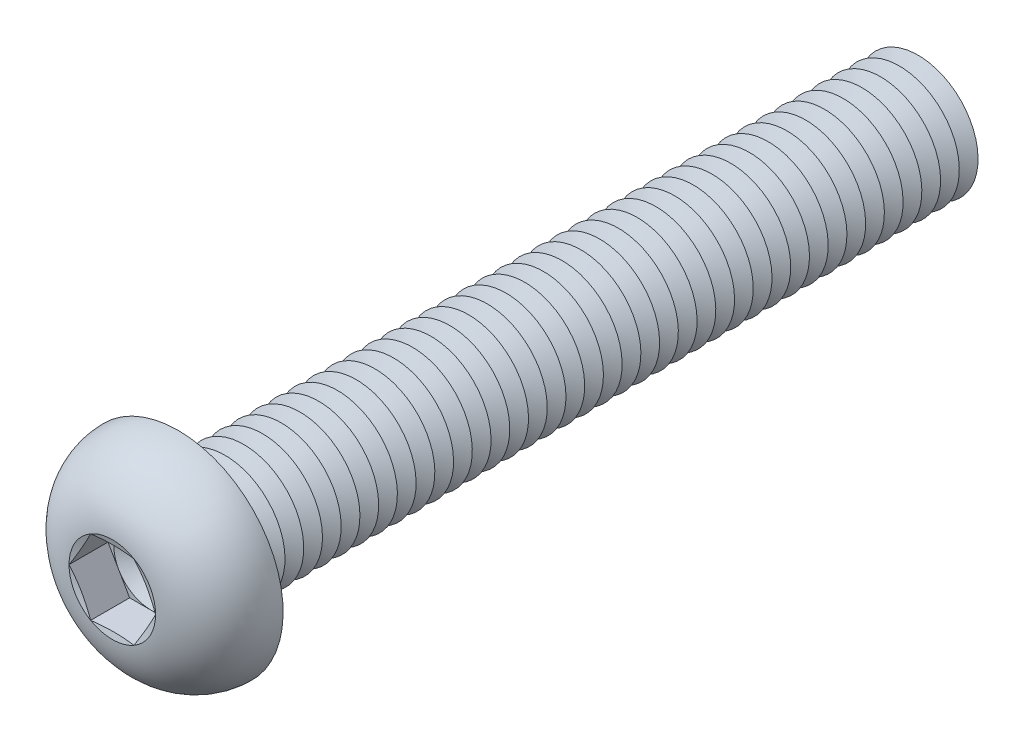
from build123d import *

# Parameters (mm, degrees)
FILLET1_R          = 0.625
LPATTERN1_COUNT    = 40
LPATTERN1_PITCH    = 1.25
CUT_EXTRUDE1_DEPTH = 2.6


with BuildPart() as part:
    # Sketch1 → Revolve1 (revolve)
    with BuildSketch(Plane(origin=(0, 0, 0), x_dir=(0, 0, -1), z_dir=(1, 0, 0))):
        with BuildLine():
            Line((0, 4), (0, 7))
            ThreePointArc((0, 7), (-3.011595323, 5.81154966), (-4.4, 2.88675))
            Line((-4.4, 2.88675), (-4.013248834, 1.443375))
            Line((-4.013248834, 1.443375), (-4.4, 1.443375))
            Line((-4.4, 1.443375), (-4.4, 0))
            Line((-4.4, 0), (50, 0))
            Line((50, 0), (50, 4))
            Line((50, 4), (0, 4))
        make_face()
    revolve(axis=Axis((0, 0, -50), (0, 0, 1)))

    # Fillet1
    fillet1_edges = [part.edges().sort_by_distance(p)[0] for p in [
        (0, -4, 0),
    ]]
    fillet(fillet1_edges, radius=FILLET1_R)

    # Sketch2 → Cut-Revolve1 (revolve, cut)
    with BuildSketch(Plane(origin=(0, 0, 0), x_dir=(0, 0, -1), z_dir=(1, 0, 0))):
        Polygon((49.375, 4), (50.625, 4), (50, 2.917468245), align=None)
    cut_revolve1 = revolve(axis=Axis((0, 0, -50), (0, 0, -1)), mode=Mode.SUBTRACT)

    # LPattern1: Cut-Revolve1 ×40
    with Locations(*[(0, 0, i * LPATTERN1_PITCH) for i in range(1, LPATTERN1_COUNT)]):
        add(cut_revolve1, mode=Mode.SUBTRACT)

    # Sketch3 → Cut-Extrude1 (cut)
    with BuildSketch(Plane.XY.offset(4.4)):
        Polygon((1.443375, 2.499998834), (-1.443375, 2.499998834), (-2.88675, 0), (-1.443375, -2.499998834), (1.443375, -2.499998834), (2.88675, 0), align=None)
    extrude(amount=-CUT_EXTRUDE1_DEPTH, mode=Mode.SUBTRACT)

    # Cut-Extrude2 cone 1 section (on through the dimple's axis) → Cut-Extrude2 (revolve, cut)
    with BuildSketch(Plane(origin=(0, 0, 1.8), x_dir=(0, -1, 0), z_dir=(1, 0, 0))):
        Polygon((0, 0), (2.499998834, 0), (0, 1.443375), align=None)
    revolve(axis=Axis((0, 0, 1.8), (0, 0, -1)), mode=Mode.SUBTRACT)


solid = part.part
